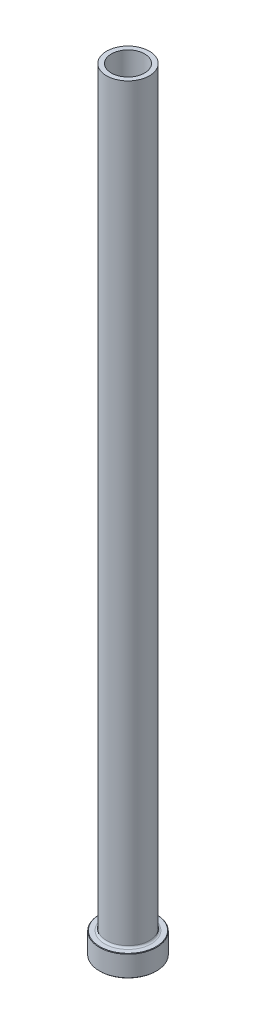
ISO-10303-21;
HEADER;
FILE_DESCRIPTION(('STEP AP214'),'2;1');
FILE_NAME('part.step','',(''),(''),'','','');
FILE_SCHEMA(('AUTOMOTIVE_DESIGN { 1 0 10303 214 1 1 1 1 }'));
ENDSEC;
DATA;
#1=APPLICATION_CONTEXT('core data for automotive mechanical design processes');
#2=APPLICATION_PROTOCOL_DEFINITION('international standard','automotive_design',2000,#1);
#3=PRODUCT_CONTEXT('',#1,'mechanical');
#4=PRODUCT('Part','Part','',(#3));
#5=PRODUCT_RELATED_PRODUCT_CATEGORY('part','',(#4));
#6=PRODUCT_DEFINITION_FORMATION('','',#4);
#7=PRODUCT_DEFINITION_CONTEXT('part definition',#1,'design');
#8=PRODUCT_DEFINITION('design','',#6,#7);
#9=PRODUCT_DEFINITION_SHAPE('','',#8);
#10=(LENGTH_UNIT() NAMED_UNIT(*) SI_UNIT(.MILLI.,.METRE.));
#11=(NAMED_UNIT(*) PLANE_ANGLE_UNIT() SI_UNIT($,.RADIAN.));
#12=(NAMED_UNIT(*) SI_UNIT($,.STERADIAN.) SOLID_ANGLE_UNIT());
#13=UNCERTAINTY_MEASURE_WITH_UNIT(LENGTH_MEASURE(1.E-05),#10,'distance_accuracy_value','');
#14=(GEOMETRIC_REPRESENTATION_CONTEXT(3) GLOBAL_UNCERTAINTY_ASSIGNED_CONTEXT((#13)) GLOBAL_UNIT_ASSIGNED_CONTEXT((#10,
#11,#12)) REPRESENTATION_CONTEXT('',''));
#15=CARTESIAN_POINT('',(0.,0.,0.));
#16=DIRECTION('',(0.,0.,1.));
#17=DIRECTION('',(1.,0.,0.));
#18=AXIS2_PLACEMENT_3D('',#15,#16,#17);
#19=CARTESIAN_POINT('',(0.,92.1876809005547,0.));
#20=DIRECTION('',(0.,1.,0.));
#21=DIRECTION('',(0.,0.,1.));
#22=AXIS2_PLACEMENT_3D('',#19,#20,#21);
#23=CYLINDRICAL_SURFACE('',#22,7.00000000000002);
#24=CARTESIAN_POINT('',(0.,325.,0.));
#25=DIRECTION('',(0.,1.,0.));
#26=DIRECTION('',(0.,0.,1.));
#27=AXIS2_PLACEMENT_3D('',#24,#25,#26);
#28=CIRCLE('',#27,7.00000000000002);
#29=CARTESIAN_POINT('',(0.,325.,7.00000000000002));
#30=VERTEX_POINT('',#29);
#31=EDGE_CURVE('E62',#30,#30,#28,.T.);
#32=ORIENTED_EDGE('',*,*,#31,.T.);
#33=EDGE_LOOP('',(#32));
#34=FACE_BOUND('',#33,.T.);
#35=CARTESIAN_POINT('',(0.,270.,0.));
#36=DIRECTION('',(0.,1.,0.));
#37=DIRECTION('',(0.,0.,1.));
#38=AXIS2_PLACEMENT_3D('',#35,#36,#37);
#39=CIRCLE('',#38,7.00000000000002);
#40=CARTESIAN_POINT('',(0.,270.,7.00000000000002));
#41=VERTEX_POINT('',#40);
#42=EDGE_CURVE('E71',#41,#41,#39,.T.);
#43=ORIENTED_EDGE('',*,*,#42,.F.);
#44=EDGE_LOOP('',(#43));
#45=FACE_BOUND('',#44,.T.);
#46=ADVANCED_FACE('F30',(#34,#45),#23,.F.);
#47=CARTESIAN_POINT('',(-7.00000000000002,325.,0.));
#48=DIRECTION('',(0.,1.,0.));
#49=DIRECTION('',(0.,0.,1.));
#50=AXIS2_PLACEMENT_3D('',#47,#48,#49);
#51=PLANE('',#50);
#52=CARTESIAN_POINT('',(0.,325.,0.));
#53=DIRECTION('',(0.,1.,0.));
#54=DIRECTION('',(0.,0.,1.));
#55=AXIS2_PLACEMENT_3D('',#52,#53,#54);
#56=CIRCLE('',#55,9.00000000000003);
#57=CARTESIAN_POINT('',(0.,325.,9.00000000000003));
#58=VERTEX_POINT('',#57);
#59=EDGE_CURVE('E65',#58,#58,#56,.T.);
#60=ORIENTED_EDGE('',*,*,#59,.T.);
#61=EDGE_LOOP('',(#60));
#62=FACE_BOUND('',#61,.T.);
#63=ORIENTED_EDGE('',*,*,#31,.F.);
#64=EDGE_LOOP('',(#63));
#65=FACE_BOUND('',#64,.T.);
#66=ADVANCED_FACE('F79',(#62,#65),#51,.T.);
#67=CARTESIAN_POINT('',(0.,92.1876809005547,0.));
#68=DIRECTION('',(0.,1.,0.));
#69=DIRECTION('',(0.,0.,1.));
#70=AXIS2_PLACEMENT_3D('',#67,#68,#69);
#71=CYLINDRICAL_SURFACE('',#70,9.00000000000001);
#72=CARTESIAN_POINT('',(0.,9.8,0.));
#73=DIRECTION('',(0.,1.,0.));
#74=DIRECTION('',(0.,0.,1.));
#75=AXIS2_PLACEMENT_3D('',#72,#73,#74);
#76=CIRCLE('',#75,9.00000000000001);
#77=CARTESIAN_POINT('',(0.,9.8,9.00000000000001));
#78=VERTEX_POINT('',#77);
#79=EDGE_CURVE('E59',#78,#78,#76,.T.);
#80=ORIENTED_EDGE('',*,*,#79,.T.);
#81=EDGE_LOOP('',(#80));
#82=FACE_BOUND('',#81,.T.);
#83=ORIENTED_EDGE('',*,*,#59,.F.);
#84=EDGE_LOOP('',(#83));
#85=FACE_BOUND('',#84,.T.);
#86=ADVANCED_FACE('F85',(#82,#85),#71,.T.);
#87=CARTESIAN_POINT('',(-8.99999999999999,9.,0.));
#88=DIRECTION('',(0.,1.,0.));
#89=DIRECTION('',(0.,0.,1.));
#90=AXIS2_PLACEMENT_3D('',#87,#88,#89);
#91=PLANE('',#90);
#92=CARTESIAN_POINT('',(0.,9.,0.));
#93=DIRECTION('',(0.,1.,0.));
#94=DIRECTION('',(0.,0.,1.));
#95=AXIS2_PLACEMENT_3D('',#92,#93,#94);
#96=CIRCLE('',#95,11.8);
#97=CARTESIAN_POINT('',(0.,9.,11.8));
#98=VERTEX_POINT('',#97);
#99=EDGE_CURVE('E53',#98,#98,#96,.T.);
#100=ORIENTED_EDGE('',*,*,#99,.T.);
#101=EDGE_LOOP('',(#100));
#102=FACE_BOUND('',#101,.T.);
#103=CARTESIAN_POINT('',(0.,9.,0.));
#104=DIRECTION('',(0.,1.,0.));
#105=DIRECTION('',(0.,0.,1.));
#106=AXIS2_PLACEMENT_3D('',#103,#104,#105);
#107=CIRCLE('',#106,9.80000000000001);
#108=CARTESIAN_POINT('',(0.,9.,9.80000000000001));
#109=VERTEX_POINT('',#108);
#110=EDGE_CURVE('E56',#109,#109,#107,.F.);
#111=ORIENTED_EDGE('',*,*,#110,.T.);
#112=EDGE_LOOP('',(#111));
#113=FACE_BOUND('',#112,.T.);
#114=ADVANCED_FACE('F111',(#102,#113),#91,.T.);
#115=CARTESIAN_POINT('',(0.,92.1876809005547,0.));
#116=DIRECTION('',(0.,1.,0.));
#117=DIRECTION('',(0.,0.,1.));
#118=AXIS2_PLACEMENT_3D('',#115,#116,#117);
#119=CYLINDRICAL_SURFACE('',#118,12.);
#120=CARTESIAN_POINT('',(0.,8.8,0.));
#121=DIRECTION('',(0.,1.,0.));
#122=DIRECTION('',(0.,0.,1.));
#123=AXIS2_PLACEMENT_3D('',#120,#121,#122);
#124=CIRCLE('',#123,12.);
#125=CARTESIAN_POINT('',(0.,8.8,12.));
#126=VERTEX_POINT('',#125);
#127=EDGE_CURVE('E45',#126,#126,#124,.F.);
#128=ORIENTED_EDGE('',*,*,#127,.T.);
#129=EDGE_LOOP('',(#128));
#130=FACE_BOUND('',#129,.T.);
#131=CARTESIAN_POINT('',(0.,0.19999999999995,0.));
#132=DIRECTION('',(0.,-1.,0.));
#133=DIRECTION('',(0.,0.,-1.));
#134=AXIS2_PLACEMENT_3D('',#131,#132,#133);
#135=CIRCLE('',#134,12.);
#136=CARTESIAN_POINT('',(0.,0.19999999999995,12.));
#137=VERTEX_POINT('',#136);
#138=EDGE_CURVE('E50',#137,#137,#135,.F.);
#139=ORIENTED_EDGE('',*,*,#138,.T.);
#140=EDGE_LOOP('',(#139));
#141=FACE_BOUND('',#140,.T.);
#142=ADVANCED_FACE('F108',(#130,#141),#119,.T.);
#143=CARTESIAN_POINT('',(-12.,0.,0.));
#144=DIRECTION('',(0.,-1.,0.));
#145=DIRECTION('',(0.,0.,-1.));
#146=AXIS2_PLACEMENT_3D('',#143,#144,#145);
#147=PLANE('',#146);
#148=CARTESIAN_POINT('',(0.,0.,0.));
#149=DIRECTION('',(0.,-1.,0.));
#150=DIRECTION('',(0.,0.,-1.));
#151=AXIS2_PLACEMENT_3D('',#148,#149,#150);
#152=CIRCLE('',#151,7.74999999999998);
#153=CARTESIAN_POINT('',(0.,0.,-7.74999999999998));
#154=VERTEX_POINT('',#153);
#155=EDGE_CURVE('E37',#154,#154,#152,.F.);
#156=ORIENTED_EDGE('',*,*,#155,.T.);
#157=EDGE_LOOP('',(#156));
#158=FACE_BOUND('',#157,.T.);
#159=CARTESIAN_POINT('',(0.,0.,0.));
#160=DIRECTION('',(0.,-1.,0.));
#161=DIRECTION('',(0.,0.,-1.));
#162=AXIS2_PLACEMENT_3D('',#159,#160,#161);
#163=CIRCLE('',#162,11.8);
#164=CARTESIAN_POINT('',(0.,0.,11.8));
#165=VERTEX_POINT('',#164);
#166=EDGE_CURVE('E41',#165,#165,#163,.T.);
#167=ORIENTED_EDGE('',*,*,#166,.T.);
#168=EDGE_LOOP('',(#167));
#169=FACE_BOUND('',#168,.T.);
#170=ADVANCED_FACE('F110',(#158,#169),#147,.T.);
#171=CARTESIAN_POINT('',(0.,92.1876809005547,0.));
#172=DIRECTION('',(0.,1.,0.));
#173=DIRECTION('',(0.,0.,1.));
#174=AXIS2_PLACEMENT_3D('',#171,#172,#173);
#175=CYLINDRICAL_SURFACE('',#174,7.25000000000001);
#176=CARTESIAN_POINT('',(0.,0.5,0.));
#177=DIRECTION('',(0.,-1.,0.));
#178=DIRECTION('',(0.,0.,-1.));
#179=AXIS2_PLACEMENT_3D('',#176,#177,#178);
#180=CIRCLE('',#179,7.25000000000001);
#181=CARTESIAN_POINT('',(0.,0.5,-7.25000000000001));
#182=VERTEX_POINT('',#181);
#183=EDGE_CURVE('E10',#182,#182,#180,.T.);
#184=ORIENTED_EDGE('',*,*,#183,.T.);
#185=EDGE_LOOP('',(#184));
#186=FACE_BOUND('',#185,.T.);
#187=CARTESIAN_POINT('',(0.,258.,0.));
#188=DIRECTION('',(0.,1.,0.));
#189=DIRECTION('',(0.,0.,1.));
#190=AXIS2_PLACEMENT_3D('',#187,#188,#189);
#191=CIRCLE('',#190,7.25000000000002);
#192=CARTESIAN_POINT('',(0.,258.,7.25000000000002));
#193=VERTEX_POINT('',#192);
#194=EDGE_CURVE('E68',#193,#193,#191,.T.);
#195=ORIENTED_EDGE('',*,*,#194,.T.);
#196=EDGE_LOOP('',(#195));
#197=FACE_BOUND('',#196,.T.);
#198=ADVANCED_FACE('F118',(#186,#197),#175,.F.);
#199=CARTESIAN_POINT('',(0.,258.,0.));
#200=DIRECTION('',(0.,-1.,0.));
#201=DIRECTION('',(0.,0.,-1.));
#202=AXIS2_PLACEMENT_3D('',#199,#200,#201);
#203=CONICAL_SURFACE('',#202,7.25000000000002,0.0208303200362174);
#204=ORIENTED_EDGE('',*,*,#42,.T.);
#205=EDGE_LOOP('',(#204));
#206=FACE_BOUND('',#205,.T.);
#207=ORIENTED_EDGE('',*,*,#194,.F.);
#208=EDGE_LOOP('',(#207));
#209=FACE_BOUND('',#208,.T.);
#210=ADVANCED_FACE('F75',(#206,#209),#203,.F.);
#211=CARTESIAN_POINT('',(0.,9.8,0.));
#212=DIRECTION('',(0.,1.,0.));
#213=DIRECTION('',(0.,0.,1.));
#214=AXIS2_PLACEMENT_3D('',#211,#212,#213);
#215=TOROIDAL_SURFACE('',#214,9.80000000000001,0.8);
#216=ORIENTED_EDGE('',*,*,#110,.F.);
#217=EDGE_LOOP('',(#216));
#218=FACE_BOUND('',#217,.T.);
#219=ORIENTED_EDGE('',*,*,#79,.F.);
#220=EDGE_LOOP('',(#219));
#221=FACE_BOUND('',#220,.T.);
#222=ADVANCED_FACE('F90',(#218,#221),#215,.F.);
#223=CARTESIAN_POINT('',(0.,9.00000000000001,0.));
#224=DIRECTION('',(0.,-1.,0.));
#225=DIRECTION('',(0.,0.,-1.));
#226=AXIS2_PLACEMENT_3D('',#223,#224,#225);
#227=CONICAL_SURFACE('',#226,11.8,0.785398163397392);
#228=ORIENTED_EDGE('',*,*,#127,.F.);
#229=EDGE_LOOP('',(#228));
#230=FACE_BOUND('',#229,.T.);
#231=ORIENTED_EDGE('',*,*,#99,.F.);
#232=EDGE_LOOP('',(#231));
#233=FACE_BOUND('',#232,.T.);
#234=ADVANCED_FACE('F93',(#230,#233),#227,.T.);
#235=CARTESIAN_POINT('',(0.,0.19999999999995,0.));
#236=DIRECTION('',(0.,1.,0.));
#237=DIRECTION('',(0.,0.,1.));
#238=AXIS2_PLACEMENT_3D('',#235,#236,#237);
#239=CONICAL_SURFACE('',#238,12.,0.785398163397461);
#240=CARTESIAN_POINT('',(0.,0.,11.8));
#241=CARTESIAN_POINT('',(0.,0.00208333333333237,11.8020833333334));
#242=CARTESIAN_POINT('',(0.,0.00416666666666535,11.8041666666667));
#243=CARTESIAN_POINT('',(0.,0.0083333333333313,11.8083333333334));
#244=CARTESIAN_POINT('',(0.,0.0104166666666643,11.8104166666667));
#245=CARTESIAN_POINT('',(0.,0.0145833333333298,11.8145833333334));
#246=CARTESIAN_POINT('',(0.,0.0166666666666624,11.8166666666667));
#247=CARTESIAN_POINT('',(0.,0.020833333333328,11.8208333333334));
#248=CARTESIAN_POINT('',(0.,0.0229166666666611,11.8229166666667));
#249=CARTESIAN_POINT('',(0.,0.0270833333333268,11.8270833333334));
#250=CARTESIAN_POINT('',(0.,0.0291666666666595,11.8291666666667));
#251=CARTESIAN_POINT('',(0.,0.033333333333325,11.8333333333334));
#252=CARTESIAN_POINT('',(0.,0.0354166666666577,11.8354166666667));
#253=CARTESIAN_POINT('',(0.,0.0395833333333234,11.8395833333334));
#254=CARTESIAN_POINT('',(0.,0.0416666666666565,11.8416666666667));
#255=CARTESIAN_POINT('',(0.,0.0458333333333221,11.8458333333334));
#256=CARTESIAN_POINT('',(0.,0.0479166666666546,11.8479166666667));
#257=CARTESIAN_POINT('',(0.,0.0520833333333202,11.8520833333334));
#258=CARTESIAN_POINT('',(0.,0.0541666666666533,11.8541666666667));
#259=CARTESIAN_POINT('',(0.,0.058333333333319,11.8583333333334));
#260=CARTESIAN_POINT('',(0.,0.0604166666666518,11.8604166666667));
#261=CARTESIAN_POINT('',(0.,0.0645833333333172,11.8645833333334));
#262=CARTESIAN_POINT('',(0.,0.0666666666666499,11.8666666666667));
#263=CARTESIAN_POINT('',(0.,0.0708333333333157,11.8708333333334));
#264=CARTESIAN_POINT('',(0.,0.0729166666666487,11.8729166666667));
#265=CARTESIAN_POINT('',(0.,0.0770833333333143,11.8770833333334));
#266=CARTESIAN_POINT('',(0.,0.0791666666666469,11.8791666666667));
#267=CARTESIAN_POINT('',(0.,0.0833333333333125,11.8833333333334));
#268=CARTESIAN_POINT('',(0.,0.0854166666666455,11.8854166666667));
#269=CARTESIAN_POINT('',(0.,0.0895833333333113,11.8895833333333));
#270=CARTESIAN_POINT('',(0.,0.091666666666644,11.8916666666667));
#271=CARTESIAN_POINT('',(0.,0.0958333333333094,11.8958333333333));
#272=CARTESIAN_POINT('',(0.,0.0979166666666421,11.8979166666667));
#273=CARTESIAN_POINT('',(0.,0.102083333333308,11.9020833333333));
#274=CARTESIAN_POINT('',(0.,0.104166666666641,11.9041666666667));
#275=CARTESIAN_POINT('',(0.,0.108333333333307,11.9083333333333));
#276=CARTESIAN_POINT('',(0.,0.110416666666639,11.9104166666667));
#277=CARTESIAN_POINT('',(0.,0.114583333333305,11.9145833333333));
#278=CARTESIAN_POINT('',(0.,0.116666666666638,11.9166666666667));
#279=CARTESIAN_POINT('',(0.,0.120833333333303,11.9208333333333));
#280=CARTESIAN_POINT('',(0.,0.122916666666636,11.9229166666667));
#281=CARTESIAN_POINT('',(0.,0.127083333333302,11.9270833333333));
#282=CARTESIAN_POINT('',(0.,0.129166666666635,11.9291666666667));
#283=CARTESIAN_POINT('',(0.,0.1333333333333,11.9333333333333));
#284=CARTESIAN_POINT('',(0.,0.135416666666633,11.9354166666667));
#285=CARTESIAN_POINT('',(0.,0.139583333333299,11.9395833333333));
#286=CARTESIAN_POINT('',(0.,0.141666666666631,11.9416666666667));
#287=CARTESIAN_POINT('',(0.,0.145833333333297,11.9458333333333));
#288=CARTESIAN_POINT('',(0.,0.14791666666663,11.9479166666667));
#289=CARTESIAN_POINT('',(0.,0.152083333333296,11.9520833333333));
#290=CARTESIAN_POINT('',(0.,0.154166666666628,11.9541666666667));
#291=CARTESIAN_POINT('',(0.,0.158333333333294,11.9583333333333));
#292=CARTESIAN_POINT('',(0.,0.160416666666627,11.9604166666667));
#293=CARTESIAN_POINT('',(0.,0.164583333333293,11.9645833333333));
#294=CARTESIAN_POINT('',(0.,0.166666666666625,11.9666666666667));
#295=CARTESIAN_POINT('',(0.,0.170833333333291,11.9708333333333));
#296=CARTESIAN_POINT('',(0.,0.172916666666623,11.9729166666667));
#297=CARTESIAN_POINT('',(0.,0.177083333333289,11.9770833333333));
#298=CARTESIAN_POINT('',(0.,0.179166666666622,11.9791666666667));
#299=CARTESIAN_POINT('',(0.,0.183333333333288,11.9833333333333));
#300=CARTESIAN_POINT('',(0.,0.18541666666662,11.9854166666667));
#301=CARTESIAN_POINT('',(0.,0.189583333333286,11.9895833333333));
#302=CARTESIAN_POINT('',(0.,0.191666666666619,11.9916666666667));
#303=CARTESIAN_POINT('',(0.,0.195833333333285,11.9958333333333));
#304=CARTESIAN_POINT('',(0.,0.197916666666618,11.9979166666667));
#305=CARTESIAN_POINT('',(0.,0.19999999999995,12.));
#306=B_SPLINE_CURVE_WITH_KNOTS('',3,(#240,#241,#242,#243,#244,#245,#246,#247,#248,#249,#250,
#251,#252,#253,#254,#255,#256,#257,#258,#259,#260,#261,#262,#263,#264,#265,#266,#267,#268,#269,
#270,#271,#272,#273,#274,#275,#276,#277,#278,#279,#280,#281,#282,#283,#284,#285,#286,#287,#288,
#289,#290,#291,#292,#293,#294,#295,#296,#297,#298,#299,#300,#301,#302,#303,#304,#305),
.UNSPECIFIED.,.F.,.F.,(4,2,2,2,2,2,2,2,2,2,2,2,2,2,2,2,2,2,2,2,2,2,2,2,2,2,2,2,2,2,2,2,4),(0.,
0.00883883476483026,0.0176776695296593,0.0265165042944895,0.0353553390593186,0.0441941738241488,
0.0530330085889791,0.0618718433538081,0.0707106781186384,0.0795495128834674,0.0883883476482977,
0.0972271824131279,0.106066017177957,0.114904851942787,0.123743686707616,0.132582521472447,
0.141421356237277,0.150260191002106,0.159099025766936,0.167937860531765,0.176776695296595,
0.185615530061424,0.194454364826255,0.203293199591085,0.212132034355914,0.220970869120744,
0.229809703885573,0.238648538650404,0.247487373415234,0.256326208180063,0.265165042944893,
0.274003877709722,0.282842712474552),.UNSPECIFIED.);
#307=EDGE_CURVE('BSEAM96',#165,#137,#306,.T.);
#308=ORIENTED_EDGE('',*,*,#166,.F.);
#309=ORIENTED_EDGE('',*,*,#138,.F.);
#310=ORIENTED_EDGE('',*,*,#307,.T.);
#311=ORIENTED_EDGE('',*,*,#307,.F.);
#312=EDGE_LOOP('',(#308,#310,#309,#311));
#313=FACE_BOUND('',#312,.T.);
#314=ADVANCED_FACE('F96',(#313),#239,.T.);
#315=CARTESIAN_POINT('',(0.,0.,0.));
#316=DIRECTION('',(0.,-1.,0.));
#317=DIRECTION('',(0.,0.,-1.));
#318=AXIS2_PLACEMENT_3D('',#315,#316,#317);
#319=CONICAL_SURFACE('',#318,7.74999999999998,0.785398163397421);
#320=ORIENTED_EDGE('',*,*,#183,.F.);
#321=EDGE_LOOP('',(#320));
#322=FACE_BOUND('',#321,.T.);
#323=ORIENTED_EDGE('',*,*,#155,.F.);
#324=EDGE_LOOP('',(#323));
#325=FACE_BOUND('',#324,.T.);
#326=ADVANCED_FACE('F32',(#322,#325),#319,.F.);
#327=CLOSED_SHELL('',(#46,#66,#86,#114,#142,#170,#198,#210,#222,#234,#314,#326));
#328=MANIFOLD_SOLID_BREP('B2',#327);
#329=ADVANCED_BREP_SHAPE_REPRESENTATION('',(#18,#328),#14);
#330=SHAPE_DEFINITION_REPRESENTATION(#9,#329);
ENDSEC;
END-ISO-10303-21;
